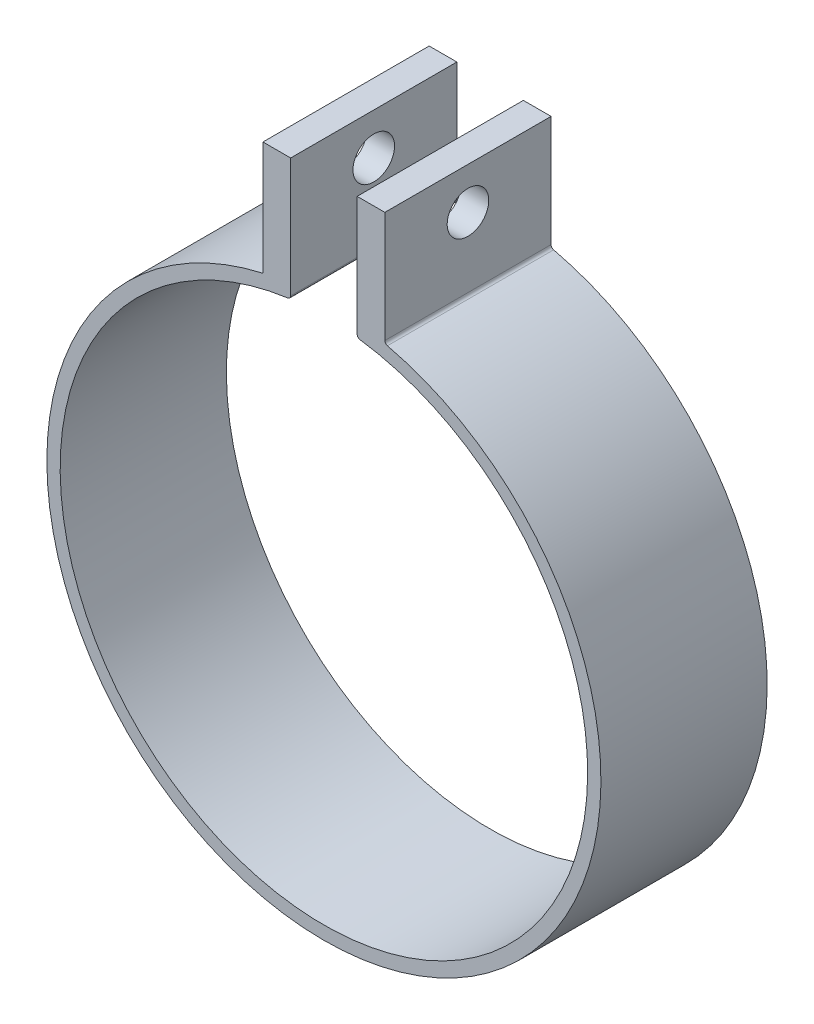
from build123d import *

# Parameters (mm, degrees)
BASE_EXTRUDE_DEPTH = 38.1
SKETCH2_R          = 4.7625
CUT_EXTRUDE1_DEPTH = 124.280055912


with BuildPart() as part:
    # Sketch1 → Base-Extrude (new body)
    with BuildSketch(Plane.XY):
        with BuildLine():
            Line((7.62, 60.637413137), (7.62, 88.004325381))
            Line((7.62, 88.004325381), (13.97, 88.004325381))
            Line((13.97, 88.004325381), (13.97, 62.550562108))
            ThreePointArc((13.97, 62.550562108), (14.134607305, 62.077523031), (14.557312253, 61.808855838))
            ThreePointArc((14.557312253, 61.808855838), (-0.30135737, -63.499284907), (-13.97, 61.944241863))
            Line((-13.97, 61.944241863), (-13.97, 88.004325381))
            Line((-13.97, 88.004325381), (-7.62, 88.004325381))
            Line((-7.62, 88.004325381), (-7.62, 60.637413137))
            ThreePointArc((-7.62, 60.637413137), (-7.807477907, 60.136845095), (-8.277659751, 59.882590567))
            ThreePointArc((-8.277659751, 59.882590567), (0, -60.452), (8.277659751, 59.882590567))
            ThreePointArc((8.277659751, 59.882590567), (7.807477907, 60.136845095), (7.62, 60.637413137))
        make_face()
    extrude(amount=BASE_EXTRUDE_DEPTH)

    # Sketch2 → Cut-Extrude1 (cut, through all)
    with BuildSketch(Plane.ZY.offset(13.97)):
        with Locations(Location((19.05, 78.479325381, 0), (0, 0, 270))):
            Circle(SKETCH2_R)
    extrude(amount=-CUT_EXTRUDE1_DEPTH, mode=Mode.SUBTRACT)


solid = part.part
